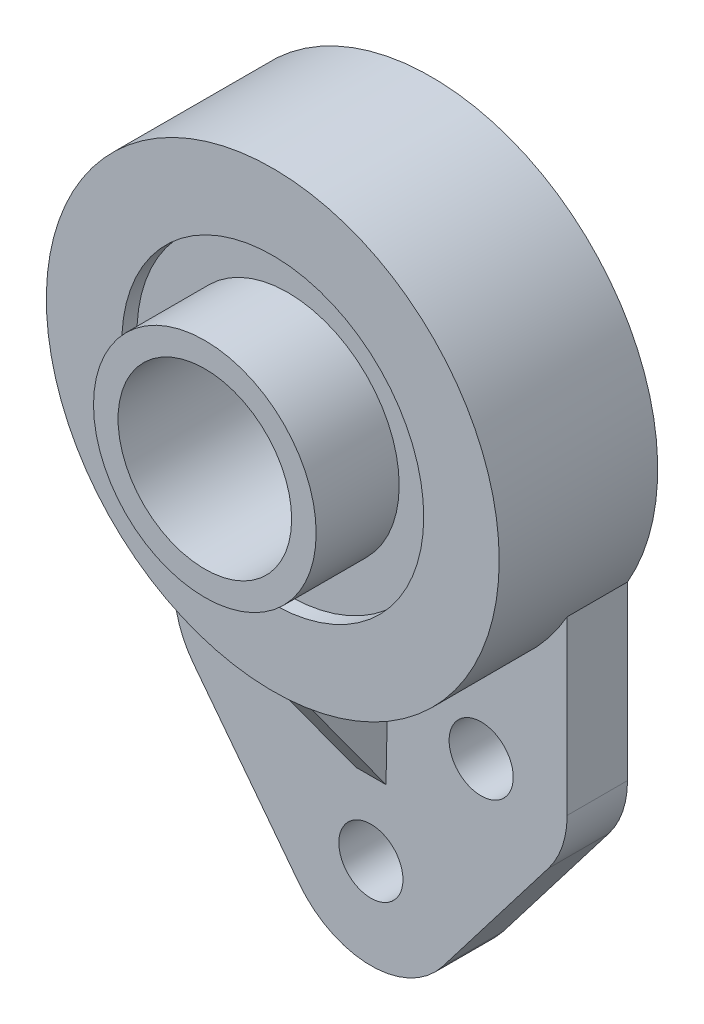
ISO-10303-21;
HEADER;
FILE_DESCRIPTION(('STEP AP214'),'2;1');
FILE_NAME('part.step','',(''),(''),'','','');
FILE_SCHEMA(('AUTOMOTIVE_DESIGN { 1 0 10303 214 1 1 1 1 }'));
ENDSEC;
DATA;
#1=APPLICATION_CONTEXT('core data for automotive mechanical design processes');
#2=APPLICATION_PROTOCOL_DEFINITION('international standard','automotive_design',2000,#1);
#3=PRODUCT_CONTEXT('',#1,'mechanical');
#4=PRODUCT('Part','Part','',(#3));
#5=PRODUCT_RELATED_PRODUCT_CATEGORY('part','',(#4));
#6=PRODUCT_DEFINITION_FORMATION('','',#4);
#7=PRODUCT_DEFINITION_CONTEXT('part definition',#1,'design');
#8=PRODUCT_DEFINITION('design','',#6,#7);
#9=PRODUCT_DEFINITION_SHAPE('','',#8);
#10=(LENGTH_UNIT() NAMED_UNIT(*) SI_UNIT(.MILLI.,.METRE.));
#11=(NAMED_UNIT(*) PLANE_ANGLE_UNIT() SI_UNIT($,.RADIAN.));
#12=(NAMED_UNIT(*) SI_UNIT($,.STERADIAN.) SOLID_ANGLE_UNIT());
#13=UNCERTAINTY_MEASURE_WITH_UNIT(LENGTH_MEASURE(1.E-05),#10,'distance_accuracy_value','');
#14=(GEOMETRIC_REPRESENTATION_CONTEXT(3) GLOBAL_UNCERTAINTY_ASSIGNED_CONTEXT((#13)) GLOBAL_UNIT_ASSIGNED_CONTEXT((#10,
#11,#12)) REPRESENTATION_CONTEXT('',''));
#15=CARTESIAN_POINT('',(0.,0.,0.));
#16=DIRECTION('',(0.,0.,1.));
#17=DIRECTION('',(1.,0.,0.));
#18=AXIS2_PLACEMENT_3D('',#15,#16,#17);
#19=CARTESIAN_POINT('',(0.,0.,30.1625));
#20=DIRECTION('',(0.,0.,1.));
#21=DIRECTION('',(1.,0.,0.));
#22=AXIS2_PLACEMENT_3D('',#19,#20,#21);
#23=PLANE('',#22);
#24=CARTESIAN_POINT('',(0.,0.,30.1625));
#25=DIRECTION('',(0.,0.,1.));
#26=DIRECTION('',(1.,0.,0.));
#27=AXIS2_PLACEMENT_3D('',#24,#25,#26);
#28=CIRCLE('',#27,31.75);
#29=CARTESIAN_POINT('',(31.75,0.,30.1625));
#30=VERTEX_POINT('',#29);
#31=EDGE_CURVE('E219',#30,#30,#28,.T.);
#32=ORIENTED_EDGE('',*,*,#31,.T.);
#33=EDGE_LOOP('',(#32));
#34=FACE_BOUND('',#33,.T.);
#35=CARTESIAN_POINT('',(0.,0.,30.1625));
#36=DIRECTION('',(0.,0.,1.));
#37=DIRECTION('',(1.,0.,0.));
#38=AXIS2_PLACEMENT_3D('',#35,#36,#37);
#39=CIRCLE('',#38,23.415625);
#40=CARTESIAN_POINT('',(23.415625,0.,30.1625));
#41=VERTEX_POINT('',#40);
#42=EDGE_CURVE('E32',#41,#41,#39,.F.);
#43=ORIENTED_EDGE('',*,*,#42,.T.);
#44=EDGE_LOOP('',(#43));
#45=FACE_BOUND('',#44,.T.);
#46=ADVANCED_FACE('F28',(#34,#45),#23,.T.);
#47=CARTESIAN_POINT('',(0.,-88.9,12.7));
#48=DIRECTION('',(0.,0.,1.));
#49=DIRECTION('',(1.,0.,0.));
#50=AXIS2_PLACEMENT_3D('',#47,#48,#49);
#51=PLANE('',#50);
#52=CARTESIAN_POINT('',(-23.1938104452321,-58.6732377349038,12.7));
#53=DIRECTION('',(0.,0.,1.));
#54=DIRECTION('',(1.,0.,0.));
#55=AXIS2_PLACEMENT_3D('',#52,#53,#54);
#56=CIRCLE('',#55,6.7437);
#57=CARTESIAN_POINT('',(-16.4501104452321,-58.6732377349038,12.7));
#58=VERTEX_POINT('',#57);
#59=EDGE_CURVE('E252',#58,#58,#56,.T.);
#60=ORIENTED_EDGE('',*,*,#59,.F.);
#61=EDGE_LOOP('',(#60));
#62=FACE_BOUND('',#61,.T.);
#63=CARTESIAN_POINT('',(23.1938104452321,-58.6732377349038,12.7));
#64=DIRECTION('',(0.,0.,1.));
#65=DIRECTION('',(1.,0.,0.));
#66=AXIS2_PLACEMENT_3D('',#63,#64,#65);
#67=CIRCLE('',#66,6.7437);
#68=CARTESIAN_POINT('',(29.9375104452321,-58.6732377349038,12.7));
#69=VERTEX_POINT('',#68);
#70=EDGE_CURVE('E246',#69,#69,#67,.T.);
#71=ORIENTED_EDGE('',*,*,#70,.F.);
#72=EDGE_LOOP('',(#71));
#73=FACE_BOUND('',#72,.T.);
#74=CARTESIAN_POINT('',(0.,-88.9,12.7));
#75=DIRECTION('',(0.,0.,1.));
#76=DIRECTION('',(1.,0.,0.));
#77=AXIS2_PLACEMENT_3D('',#74,#75,#76);
#78=CIRCLE('',#77,6.7437);
#79=CARTESIAN_POINT('',(6.74369999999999,-88.9,12.7));
#80=VERTEX_POINT('',#79);
#81=EDGE_CURVE('E240',#80,#80,#78,.T.);
#82=ORIENTED_EDGE('',*,*,#81,.F.);
#83=EDGE_LOOP('',(#82));
#84=FACE_BOUND('',#83,.T.);
#85=DIRECTION('',(0.0205273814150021,0.999789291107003,0.));
#86=VECTOR('',#85,1.);
#87=CARTESIAN_POINT('',(2.85509870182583,-88.9586200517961,12.7));
#88=LINE('',#87,#86);
#89=CARTESIAN_POINT('',(3.175,-73.3777777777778,12.7));
#90=VERTEX_POINT('',#89);
#91=CARTESIAN_POINT('',(3.70671468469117,-47.4805317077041,12.7));
#92=VERTEX_POINT('',#91);
#93=EDGE_CURVE('E44',#90,#92,#88,.T.);
#94=ORIENTED_EDGE('',*,*,#93,.F.);
#95=DIRECTION('',(1.,0.,0.));
#96=VECTOR('',#95,1.);
#97=CARTESIAN_POINT('',(0.,-73.3777777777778,12.7));
#98=LINE('',#97,#96);
#99=CARTESIAN_POINT('',(-3.175,-73.3777777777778,12.7));
#100=VERTEX_POINT('',#99);
#101=EDGE_CURVE('E48',#100,#90,#98,.T.);
#102=ORIENTED_EDGE('',*,*,#101,.F.);
#103=DIRECTION('',(-0.0205273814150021,0.999789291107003,0.));
#104=VECTOR('',#103,1.);
#105=CARTESIAN_POINT('',(-2.85509870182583,-88.9586200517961,12.7));
#106=LINE('',#105,#104);
#107=CARTESIAN_POINT('',(-3.70671468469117,-47.4805317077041,12.7));
#108=VERTEX_POINT('',#107);
#109=EDGE_CURVE('E123',#100,#108,#106,.T.);
#110=ORIENTED_EDGE('',*,*,#109,.T.);
#111=CARTESIAN_POINT('',(0.,0.,12.7));
#112=DIRECTION('',(0.,0.,1.));
#113=DIRECTION('',(1.,0.,0.));
#114=AXIS2_PLACEMENT_3D('',#111,#112,#113);
#115=CIRCLE('',#114,47.625);
#116=CARTESIAN_POINT('',(-41.275,-23.7595244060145,12.7));
#117=VERTEX_POINT('',#116);
#118=EDGE_CURVE('E111',#108,#117,#115,.F.);
#119=ORIENTED_EDGE('',*,*,#118,.T.);
#120=DIRECTION('',(0.,1.,0.));
#121=VECTOR('',#120,1.);
#122=CARTESIAN_POINT('',(-41.275,-59.9358160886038,12.7));
#123=LINE('',#122,#121);
#124=CARTESIAN_POINT('',(-41.275,-59.9358160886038,12.7));
#125=VERTEX_POINT('',#124);
#126=EDGE_CURVE('E174',#125,#117,#123,.T.);
#127=ORIENTED_EDGE('',*,*,#126,.F.);
#128=CARTESIAN_POINT('',(-22.225,-59.9358160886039,12.7));
#129=DIRECTION('',(0.,0.,-1.));
#130=DIRECTION('',(-1.,0.,0.));
#131=AXIS2_PLACEMENT_3D('',#128,#129,#130);
#132=CIRCLE('',#131,19.05);
#133=CARTESIAN_POINT('',(-37.3383811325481,-71.5327213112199,12.7));
#134=VERTEX_POINT('',#133);
#135=EDGE_CURVE('E176',#134,#125,#132,.T.);
#136=ORIENTED_EDGE('',*,*,#135,.F.);
#137=DIRECTION('',(-0.608761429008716,0.793353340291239,0.));
#138=VECTOR('',#137,1.);
#139=CARTESIAN_POINT('',(-15.1133811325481,-100.496905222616,12.7));
#140=LINE('',#139,#138);
#141=CARTESIAN_POINT('',(-15.1133811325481,-100.496905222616,12.7));
#142=VERTEX_POINT('',#141);
#143=EDGE_CURVE('E179',#142,#134,#140,.T.);
#144=ORIENTED_EDGE('',*,*,#143,.F.);
#145=CARTESIAN_POINT('',(0.,-88.9,12.7));
#146=DIRECTION('',(0.,0.,1.));
#147=DIRECTION('',(1.,0.,0.));
#148=AXIS2_PLACEMENT_3D('',#145,#146,#147);
#149=CIRCLE('',#148,19.05);
#150=CARTESIAN_POINT('',(15.1133811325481,-100.496905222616,12.7));
#151=VERTEX_POINT('',#150);
#152=EDGE_CURVE('E165',#142,#151,#149,.T.);
#153=ORIENTED_EDGE('',*,*,#152,.T.);
#154=DIRECTION('',(0.608761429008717,0.793353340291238,0.));
#155=VECTOR('',#154,1.);
#156=CARTESIAN_POINT('',(15.1133811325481,-100.496905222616,12.7));
#157=LINE('',#156,#155);
#158=CARTESIAN_POINT('',(37.3383811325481,-71.5327213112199,12.7));
#159=VERTEX_POINT('',#158);
#160=EDGE_CURVE('E168',#151,#159,#157,.T.);
#161=ORIENTED_EDGE('',*,*,#160,.T.);
#162=CARTESIAN_POINT('',(22.225,-59.9358160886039,12.7));
#163=DIRECTION('',(0.,0.,1.));
#164=DIRECTION('',(1.,0.,0.));
#165=AXIS2_PLACEMENT_3D('',#162,#163,#164);
#166=CIRCLE('',#165,19.05);
#167=CARTESIAN_POINT('',(41.275,-59.9358160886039,12.7));
#168=VERTEX_POINT('',#167);
#169=EDGE_CURVE('E170',#159,#168,#166,.T.);
#170=ORIENTED_EDGE('',*,*,#169,.T.);
#171=DIRECTION('',(0.,1.,0.));
#172=VECTOR('',#171,1.);
#173=CARTESIAN_POINT('',(41.275,-59.9358160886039,12.7));
#174=LINE('',#173,#172);
#175=CARTESIAN_POINT('',(41.275,-23.7595244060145,12.7));
#176=VERTEX_POINT('',#175);
#177=EDGE_CURVE('E172',#168,#176,#174,.T.);
#178=ORIENTED_EDGE('',*,*,#177,.T.);
#179=EDGE_CURVE('E120',#176,#92,#115,.F.);
#180=ORIENTED_EDGE('',*,*,#179,.T.);
#181=EDGE_LOOP('',(#94,#102,#110,#119,#127,#136,#144,#153,#161,#170,#178,#180));
#182=FACE_BOUND('',#181,.T.);
#183=ADVANCED_FACE('F124',(#62,#73,#84,#182),#51,.T.);
#184=CARTESIAN_POINT('',(0.,-88.9,12.7));
#185=DIRECTION('',(0.,0.,-1.));
#186=DIRECTION('',(-1.,0.,0.));
#187=AXIS2_PLACEMENT_3D('',#184,#185,#186);
#188=CYLINDRICAL_SURFACE('',#187,19.05);
#189=CARTESIAN_POINT('',(0.,-88.9,0.));
#190=DIRECTION('',(0.,0.,1.));
#191=DIRECTION('',(1.,0.,0.));
#192=AXIS2_PLACEMENT_3D('',#189,#190,#191);
#193=CIRCLE('',#192,19.05);
#194=CARTESIAN_POINT('',(-15.1133811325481,-100.496905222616,0.));
#195=VERTEX_POINT('',#194);
#196=CARTESIAN_POINT('',(15.1133811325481,-100.496905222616,0.));
#197=VERTEX_POINT('',#196);
#198=EDGE_CURVE('E145',#195,#197,#193,.T.);
#199=ORIENTED_EDGE('',*,*,#198,.T.);
#200=DIRECTION('',(0.,0.,-1.));
#201=VECTOR('',#200,1.);
#202=CARTESIAN_POINT('',(15.1133811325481,-100.496905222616,12.7));
#203=LINE('',#202,#201);
#204=EDGE_CURVE('E11',#151,#197,#203,.T.);
#205=ORIENTED_EDGE('',*,*,#204,.F.);
#206=ORIENTED_EDGE('',*,*,#152,.F.);
#207=DIRECTION('',(0.,0.,-1.));
#208=VECTOR('',#207,1.);
#209=CARTESIAN_POINT('',(-15.1133811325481,-100.496905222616,12.7));
#210=LINE('',#209,#208);
#211=EDGE_CURVE('E182',#142,#195,#210,.T.);
#212=ORIENTED_EDGE('',*,*,#211,.T.);
#213=EDGE_LOOP('',(#199,#205,#206,#212));
#214=FACE_BOUND('',#213,.T.);
#215=ADVANCED_FACE('F30',(#214),#188,.T.);
#216=CARTESIAN_POINT('',(15.1133811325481,-100.496905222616,12.7));
#217=DIRECTION('',(-0.793353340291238,0.608761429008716,0.));
#218=DIRECTION('',(-0.608761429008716,-0.793353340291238,0.));
#219=AXIS2_PLACEMENT_3D('',#216,#217,#218);
#220=PLANE('',#219);
#221=DIRECTION('',(0.608761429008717,0.793353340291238,0.));
#222=VECTOR('',#221,1.);
#223=CARTESIAN_POINT('',(15.1133811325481,-100.496905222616,0.));
#224=LINE('',#223,#222);
#225=CARTESIAN_POINT('',(37.3383811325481,-71.5327213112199,0.));
#226=VERTEX_POINT('',#225);
#227=EDGE_CURVE('E148',#197,#226,#224,.T.);
#228=ORIENTED_EDGE('',*,*,#227,.T.);
#229=DIRECTION('',(0.,0.,-1.));
#230=VECTOR('',#229,1.);
#231=CARTESIAN_POINT('',(37.3383811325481,-71.5327213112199,12.7));
#232=LINE('',#231,#230);
#233=EDGE_CURVE('E37',#159,#226,#232,.T.);
#234=ORIENTED_EDGE('',*,*,#233,.F.);
#235=ORIENTED_EDGE('',*,*,#160,.F.);
#236=ORIENTED_EDGE('',*,*,#204,.T.);
#237=EDGE_LOOP('',(#228,#234,#235,#236));
#238=FACE_BOUND('',#237,.T.);
#239=ADVANCED_FACE('F326',(#238),#220,.F.);
#240=CARTESIAN_POINT('',(22.225,-59.9358160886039,12.7));
#241=DIRECTION('',(0.,0.,-1.));
#242=DIRECTION('',(-1.,0.,0.));
#243=AXIS2_PLACEMENT_3D('',#240,#241,#242);
#244=CYLINDRICAL_SURFACE('',#243,19.05);
#245=CARTESIAN_POINT('',(22.225,-59.9358160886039,0.));
#246=DIRECTION('',(0.,0.,1.));
#247=DIRECTION('',(1.,0.,0.));
#248=AXIS2_PLACEMENT_3D('',#245,#246,#247);
#249=CIRCLE('',#248,19.05);
#250=CARTESIAN_POINT('',(41.275,-59.9358160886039,0.));
#251=VERTEX_POINT('',#250);
#252=EDGE_CURVE('E150',#226,#251,#249,.T.);
#253=ORIENTED_EDGE('',*,*,#252,.T.);
#254=DIRECTION('',(0.,0.,-1.));
#255=VECTOR('',#254,1.);
#256=CARTESIAN_POINT('',(41.275,-59.9358160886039,12.7));
#257=LINE('',#256,#255);
#258=EDGE_CURVE('E192',#168,#251,#257,.T.);
#259=ORIENTED_EDGE('',*,*,#258,.F.);
#260=ORIENTED_EDGE('',*,*,#169,.F.);
#261=ORIENTED_EDGE('',*,*,#233,.T.);
#262=EDGE_LOOP('',(#253,#259,#260,#261));
#263=FACE_BOUND('',#262,.T.);
#264=ADVANCED_FACE('F200',(#263),#244,.T.);
#265=CARTESIAN_POINT('',(41.275,-59.9358160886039,12.7));
#266=DIRECTION('',(-1.,0.,0.));
#267=DIRECTION('',(0.,-1.,0.));
#268=AXIS2_PLACEMENT_3D('',#265,#266,#267);
#269=PLANE('',#268);
#270=DIRECTION('',(0.,1.,0.));
#271=VECTOR('',#270,1.);
#272=CARTESIAN_POINT('',(41.275,-59.9358160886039,0.));
#273=LINE('',#272,#271);
#274=CARTESIAN_POINT('',(41.275,-23.7595244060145,0.));
#275=VERTEX_POINT('',#274);
#276=EDGE_CURVE('E152',#251,#275,#273,.T.);
#277=ORIENTED_EDGE('',*,*,#276,.T.);
#278=DIRECTION('',(0.,0.,-1.));
#279=VECTOR('',#278,1.);
#280=CARTESIAN_POINT('',(41.275,-23.7595244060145,12.7));
#281=LINE('',#280,#279);
#282=EDGE_CURVE('E189',#176,#275,#281,.T.);
#283=ORIENTED_EDGE('',*,*,#282,.F.);
#284=ORIENTED_EDGE('',*,*,#177,.F.);
#285=ORIENTED_EDGE('',*,*,#258,.T.);
#286=EDGE_LOOP('',(#277,#283,#284,#285));
#287=FACE_BOUND('',#286,.T.);
#288=ADVANCED_FACE('F210',(#287),#269,.F.);
#289=CARTESIAN_POINT('',(0.,0.,12.7));
#290=DIRECTION('',(0.,0.,-1.));
#291=DIRECTION('',(-1.,0.,0.));
#292=AXIS2_PLACEMENT_3D('',#289,#290,#291);
#293=CYLINDRICAL_SURFACE('',#292,47.625);
#294=CARTESIAN_POINT('',(0.,0.,33.3375));
#295=DIRECTION('',(0.,0.,1.));
#296=DIRECTION('',(1.,0.,0.));
#297=AXIS2_PLACEMENT_3D('',#294,#295,#296);
#298=CIRCLE('',#297,47.625);
#299=CARTESIAN_POINT('',(47.625,0.,33.3375));
#300=VERTEX_POINT('',#299);
#301=EDGE_CURVE('E121',#300,#300,#298,.T.);
#302=ORIENTED_EDGE('',*,*,#301,.F.);
#303=EDGE_LOOP('',(#302));
#304=FACE_BOUND('',#303,.T.);
#305=CARTESIAN_POINT('',(0.,0.,0.));
#306=DIRECTION('',(0.,0.,1.));
#307=DIRECTION('',(1.,0.,0.));
#308=AXIS2_PLACEMENT_3D('',#305,#306,#307);
#309=CIRCLE('',#308,47.625);
#310=CARTESIAN_POINT('',(-41.275,-23.7595244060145,0.));
#311=VERTEX_POINT('',#310);
#312=EDGE_CURVE('E154',#275,#311,#309,.T.);
#313=ORIENTED_EDGE('',*,*,#312,.T.);
#314=DIRECTION('',(0.,0.,-1.));
#315=VECTOR('',#314,1.);
#316=CARTESIAN_POINT('',(-41.275,-23.7595244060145,12.7));
#317=LINE('',#316,#315);
#318=EDGE_CURVE('E117',#117,#311,#317,.T.);
#319=ORIENTED_EDGE('',*,*,#318,.F.);
#320=ORIENTED_EDGE('',*,*,#118,.F.);
#321=CARTESIAN_POINT('',(0.,0.,178.435256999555));
#322=DIRECTION('',(0.999390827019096,0.0205192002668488,-0.0282300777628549));
#323=DIRECTION('',(-0.0282241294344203,-0.000579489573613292,-0.999601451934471));
#324=AXIS2_PLACEMENT_3D('',#321,#322,#323);
#325=ELLIPSE('',#324,1687.03042195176,47.625);
#326=CARTESIAN_POINT('',(-3.175,-47.5190488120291,31.4955712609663));
#327=VERTEX_POINT('',#326);
#328=EDGE_CURVE('E114',#327,#108,#325,.T.);
#329=ORIENTED_EDGE('',*,*,#328,.F.);
#330=CARTESIAN_POINT('',(0.,0.,66.035075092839));
#331=DIRECTION('',(0.,-0.587951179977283,0.808896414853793));
#332=DIRECTION('',(0.,-0.808896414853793,-0.587951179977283));
#333=AXIS2_PLACEMENT_3D('',#330,#331,#332);
#334=ELLIPSE('',#333,58.8765126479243,47.625);
#335=CARTESIAN_POINT('',(3.175,-47.5190488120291,31.4955712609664));
#336=VERTEX_POINT('',#335);
#337=EDGE_CURVE('E140',#327,#336,#334,.T.);
#338=ORIENTED_EDGE('',*,*,#337,.T.);
#339=CARTESIAN_POINT('',(0.,0.,178.435256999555));
#340=DIRECTION('',(0.999390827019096,-0.0205192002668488,0.0282300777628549));
#341=DIRECTION('',(0.0282241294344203,-0.000579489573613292,-0.999601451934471));
#342=AXIS2_PLACEMENT_3D('',#339,#340,#341);
#343=ELLIPSE('',#342,1687.03042195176,47.625);
#344=EDGE_CURVE('E128',#336,#92,#343,.T.);
#345=ORIENTED_EDGE('',*,*,#344,.T.);
#346=ORIENTED_EDGE('',*,*,#179,.F.);
#347=ORIENTED_EDGE('',*,*,#282,.T.);
#348=EDGE_LOOP('',(#313,#319,#320,#329,#338,#345,#346,#347));
#349=FACE_BOUND('',#348,.T.);
#350=ADVANCED_FACE('F112',(#304,#349),#293,.T.);
#351=CARTESIAN_POINT('',(-41.275,-59.9358160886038,12.7));
#352=DIRECTION('',(-1.,0.,0.));
#353=DIRECTION('',(0.,-1.,0.));
#354=AXIS2_PLACEMENT_3D('',#351,#352,#353);
#355=PLANE('',#354);
#356=DIRECTION('',(0.,1.,0.));
#357=VECTOR('',#356,1.);
#358=CARTESIAN_POINT('',(-41.275,-59.9358160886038,0.));
#359=LINE('',#358,#357);
#360=CARTESIAN_POINT('',(-41.275,-59.9358160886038,0.));
#361=VERTEX_POINT('',#360);
#362=EDGE_CURVE('E156',#361,#311,#359,.T.);
#363=ORIENTED_EDGE('',*,*,#362,.F.);
#364=DIRECTION('',(0.,0.,-1.));
#365=VECTOR('',#364,1.);
#366=CARTESIAN_POINT('',(-41.275,-59.9358160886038,12.7));
#367=LINE('',#366,#365);
#368=EDGE_CURVE('E186',#125,#361,#367,.T.);
#369=ORIENTED_EDGE('',*,*,#368,.F.);
#370=ORIENTED_EDGE('',*,*,#126,.T.);
#371=ORIENTED_EDGE('',*,*,#318,.T.);
#372=EDGE_LOOP('',(#363,#369,#370,#371));
#373=FACE_BOUND('',#372,.T.);
#374=ADVANCED_FACE('F315',(#373),#355,.T.);
#375=CARTESIAN_POINT('',(-22.225,-59.9358160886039,12.7));
#376=DIRECTION('',(0.,0.,-1.));
#377=DIRECTION('',(-1.,0.,0.));
#378=AXIS2_PLACEMENT_3D('',#375,#376,#377);
#379=CYLINDRICAL_SURFACE('',#378,19.05);
#380=CARTESIAN_POINT('',(-22.225,-59.9358160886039,0.));
#381=DIRECTION('',(0.,0.,-1.));
#382=DIRECTION('',(-1.,0.,0.));
#383=AXIS2_PLACEMENT_3D('',#380,#381,#382);
#384=CIRCLE('',#383,19.05);
#385=CARTESIAN_POINT('',(-37.3383811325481,-71.5327213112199,0.));
#386=VERTEX_POINT('',#385);
#387=EDGE_CURVE('E159',#386,#361,#384,.T.);
#388=ORIENTED_EDGE('',*,*,#387,.F.);
#389=DIRECTION('',(0.,0.,-1.));
#390=VECTOR('',#389,1.);
#391=CARTESIAN_POINT('',(-37.3383811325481,-71.5327213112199,12.7));
#392=LINE('',#391,#390);
#393=EDGE_CURVE('E184',#134,#386,#392,.T.);
#394=ORIENTED_EDGE('',*,*,#393,.F.);
#395=ORIENTED_EDGE('',*,*,#135,.T.);
#396=ORIENTED_EDGE('',*,*,#368,.T.);
#397=EDGE_LOOP('',(#388,#394,#395,#396));
#398=FACE_BOUND('',#397,.T.);
#399=ADVANCED_FACE('F311',(#398),#379,.T.);
#400=CARTESIAN_POINT('',(-15.1133811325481,-100.496905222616,12.7));
#401=DIRECTION('',(-0.793353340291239,-0.608761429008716,0.));
#402=DIRECTION('',(0.608761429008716,-0.793353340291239,0.));
#403=AXIS2_PLACEMENT_3D('',#400,#401,#402);
#404=PLANE('',#403);
#405=DIRECTION('',(-0.608761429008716,0.793353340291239,0.));
#406=VECTOR('',#405,1.);
#407=CARTESIAN_POINT('',(-15.1133811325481,-100.496905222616,0.));
#408=LINE('',#407,#406);
#409=EDGE_CURVE('E162',#195,#386,#408,.T.);
#410=ORIENTED_EDGE('',*,*,#409,.F.);
#411=ORIENTED_EDGE('',*,*,#211,.F.);
#412=ORIENTED_EDGE('',*,*,#143,.T.);
#413=ORIENTED_EDGE('',*,*,#393,.T.);
#414=EDGE_LOOP('',(#410,#411,#412,#413));
#415=FACE_BOUND('',#414,.T.);
#416=ADVANCED_FACE('F306',(#415),#404,.T.);
#417=CARTESIAN_POINT('',(0.,-88.9,0.));
#418=DIRECTION('',(0.,0.,1.));
#419=DIRECTION('',(1.,0.,0.));
#420=AXIS2_PLACEMENT_3D('',#417,#418,#419);
#421=PLANE('',#420);
#422=CARTESIAN_POINT('',(-23.1938104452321,-58.6732377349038,0.));
#423=DIRECTION('',(0.,0.,1.));
#424=DIRECTION('',(1.,0.,0.));
#425=AXIS2_PLACEMENT_3D('',#422,#423,#424);
#426=CIRCLE('',#425,6.7437);
#427=CARTESIAN_POINT('',(-16.4501104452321,-58.6732377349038,0.));
#428=VERTEX_POINT('',#427);
#429=EDGE_CURVE('E249',#428,#428,#426,.T.);
#430=ORIENTED_EDGE('',*,*,#429,.T.);
#431=EDGE_LOOP('',(#430));
#432=FACE_BOUND('',#431,.T.);
#433=CARTESIAN_POINT('',(23.1938104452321,-58.6732377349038,0.));
#434=DIRECTION('',(0.,0.,1.));
#435=DIRECTION('',(1.,0.,0.));
#436=AXIS2_PLACEMENT_3D('',#433,#434,#435);
#437=CIRCLE('',#436,6.7437);
#438=CARTESIAN_POINT('',(29.9375104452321,-58.6732377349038,0.));
#439=VERTEX_POINT('',#438);
#440=EDGE_CURVE('E243',#439,#439,#437,.T.);
#441=ORIENTED_EDGE('',*,*,#440,.T.);
#442=EDGE_LOOP('',(#441));
#443=FACE_BOUND('',#442,.T.);
#444=CARTESIAN_POINT('',(0.,-88.9,0.));
#445=DIRECTION('',(0.,0.,1.));
#446=DIRECTION('',(1.,0.,0.));
#447=AXIS2_PLACEMENT_3D('',#444,#445,#446);
#448=CIRCLE('',#447,6.7437);
#449=CARTESIAN_POINT('',(6.74369999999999,-88.9,0.));
#450=VERTEX_POINT('',#449);
#451=EDGE_CURVE('E237',#450,#450,#448,.T.);
#452=ORIENTED_EDGE('',*,*,#451,.T.);
#453=EDGE_LOOP('',(#452));
#454=FACE_BOUND('',#453,.T.);
#455=CARTESIAN_POINT('',(0.,0.,0.));
#456=DIRECTION('',(0.,0.,1.));
#457=DIRECTION('',(1.,0.,0.));
#458=AXIS2_PLACEMENT_3D('',#455,#456,#457);
#459=CIRCLE('',#458,18.25625);
#460=CARTESIAN_POINT('',(18.25625,0.,0.));
#461=VERTEX_POINT('',#460);
#462=EDGE_CURVE('E231',#461,#461,#459,.T.);
#463=ORIENTED_EDGE('',*,*,#462,.T.);
#464=EDGE_LOOP('',(#463));
#465=FACE_BOUND('',#464,.T.);
#466=ORIENTED_EDGE('',*,*,#362,.T.);
#467=ORIENTED_EDGE('',*,*,#312,.F.);
#468=ORIENTED_EDGE('',*,*,#276,.F.);
#469=ORIENTED_EDGE('',*,*,#252,.F.);
#470=ORIENTED_EDGE('',*,*,#227,.F.);
#471=ORIENTED_EDGE('',*,*,#198,.F.);
#472=ORIENTED_EDGE('',*,*,#409,.T.);
#473=ORIENTED_EDGE('',*,*,#387,.T.);
#474=EDGE_LOOP('',(#466,#467,#468,#469,#470,#471,#472,#473));
#475=FACE_BOUND('',#474,.T.);
#476=ADVANCED_FACE('F205',(#432,#443,#454,#465,#475),#421,.F.);
#477=CARTESIAN_POINT('',(0.,0.,33.3375));
#478=DIRECTION('',(0.,0.,1.));
#479=DIRECTION('',(1.,0.,0.));
#480=AXIS2_PLACEMENT_3D('',#477,#478,#479);
#481=PLANE('',#480);
#482=CARTESIAN_POINT('',(0.,0.,33.3375));
#483=DIRECTION('',(0.,0.,1.));
#484=DIRECTION('',(1.,0.,0.));
#485=AXIS2_PLACEMENT_3D('',#482,#483,#484);
#486=CIRCLE('',#485,31.75);
#487=CARTESIAN_POINT('',(31.75,0.,33.3375));
#488=VERTEX_POINT('',#487);
#489=EDGE_CURVE('E221',#488,#488,#486,.T.);
#490=ORIENTED_EDGE('',*,*,#489,.F.);
#491=EDGE_LOOP('',(#490));
#492=FACE_BOUND('',#491,.T.);
#493=ORIENTED_EDGE('',*,*,#301,.T.);
#494=EDGE_LOOP('',(#493));
#495=FACE_BOUND('',#494,.T.);
#496=ADVANCED_FACE('F297',(#492,#495),#481,.T.);
#497=CARTESIAN_POINT('',(0.,-47.6721384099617,31.3842971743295));
#498=DIRECTION('',(0.,-0.587951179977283,0.808896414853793));
#499=DIRECTION('',(0.,-0.808896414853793,-0.587951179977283));
#500=AXIS2_PLACEMENT_3D('',#497,#498,#499);
#501=PLANE('',#500);
#502=DIRECTION('',(0.,0.808896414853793,0.587951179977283));
#503=VECTOR('',#502,1.);
#504=CARTESIAN_POINT('',(-3.175,-47.6721384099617,31.3842971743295));
#505=LINE('',#504,#503);
#506=EDGE_CURVE('E131',#327,#100,#505,.F.);
#507=ORIENTED_EDGE('',*,*,#506,.T.);
#508=ORIENTED_EDGE('',*,*,#101,.T.);
#509=DIRECTION('',(0.,-0.808896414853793,-0.587951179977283));
#510=VECTOR('',#509,1.);
#511=CARTESIAN_POINT('',(3.175,-43.2139378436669,34.624766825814));
#512=LINE('',#511,#510);
#513=EDGE_CURVE('E132',#336,#90,#512,.T.);
#514=ORIENTED_EDGE('',*,*,#513,.F.);
#515=ORIENTED_EDGE('',*,*,#337,.F.);
#516=EDGE_LOOP('',(#507,#508,#514,#515));
#517=FACE_BOUND('',#516,.T.);
#518=ADVANCED_FACE('F218',(#517),#501,.T.);
#519=CARTESIAN_POINT('',(3.175,-43.2139378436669,34.624766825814));
#520=DIRECTION('',(0.999390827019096,-0.0205192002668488,0.0282300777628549));
#521=DIRECTION('',(0.0282360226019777,0.,-0.999601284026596));
#522=AXIS2_PLACEMENT_3D('',#519,#520,#521);
#523=PLANE('',#522);
#524=ORIENTED_EDGE('',*,*,#513,.T.);
#525=ORIENTED_EDGE('',*,*,#93,.T.);
#526=ORIENTED_EDGE('',*,*,#344,.F.);
#527=EDGE_LOOP('',(#524,#525,#526));
#528=FACE_BOUND('',#527,.T.);
#529=ADVANCED_FACE('F215',(#528),#523,.T.);
#530=CARTESIAN_POINT('',(-3.175,-43.2139378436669,34.624766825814));
#531=DIRECTION('',(0.999390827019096,0.0205192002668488,-0.0282300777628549));
#532=DIRECTION('',(-0.0282360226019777,0.,-0.999601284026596));
#533=AXIS2_PLACEMENT_3D('',#530,#531,#532);
#534=PLANE('',#533);
#535=ORIENTED_EDGE('',*,*,#109,.F.);
#536=ORIENTED_EDGE('',*,*,#506,.F.);
#537=ORIENTED_EDGE('',*,*,#328,.T.);
#538=EDGE_LOOP('',(#535,#536,#537));
#539=FACE_BOUND('',#538,.T.);
#540=ADVANCED_FACE('F130',(#539),#534,.F.);
#541=CARTESIAN_POINT('',(0.,0.,30.1625));
#542=DIRECTION('',(0.,0.,1.));
#543=DIRECTION('',(1.,0.,0.));
#544=AXIS2_PLACEMENT_3D('',#541,#542,#543);
#545=CYLINDRICAL_SURFACE('',#544,31.75);
#546=ORIENTED_EDGE('',*,*,#31,.F.);
#547=EDGE_LOOP('',(#546));
#548=FACE_BOUND('',#547,.T.);
#549=ORIENTED_EDGE('',*,*,#489,.T.);
#550=EDGE_LOOP('',(#549));
#551=FACE_BOUND('',#550,.T.);
#552=ADVANCED_FACE('F292',(#548,#551),#545,.F.);
#553=CARTESIAN_POINT('',(0.,0.,47.625));
#554=DIRECTION('',(0.,0.,-1.));
#555=DIRECTION('',(-1.,0.,0.));
#556=AXIS2_PLACEMENT_3D('',#553,#554,#555);
#557=CYLINDRICAL_SURFACE('',#556,23.415625);
#558=ORIENTED_EDGE('',*,*,#42,.F.);
#559=EDGE_LOOP('',(#558));
#560=FACE_BOUND('',#559,.T.);
#561=CARTESIAN_POINT('',(0.,0.,47.625));
#562=DIRECTION('',(0.,0.,1.));
#563=DIRECTION('',(1.,0.,0.));
#564=AXIS2_PLACEMENT_3D('',#561,#562,#563);
#565=CIRCLE('',#564,23.415625);
#566=CARTESIAN_POINT('',(23.415625,0.,47.625));
#567=VERTEX_POINT('',#566);
#568=EDGE_CURVE('E228',#567,#567,#565,.T.);
#569=ORIENTED_EDGE('',*,*,#568,.F.);
#570=EDGE_LOOP('',(#569));
#571=FACE_BOUND('',#570,.T.);
#572=ADVANCED_FACE('F290',(#560,#571),#557,.T.);
#573=CARTESIAN_POINT('',(0.,0.,47.625));
#574=DIRECTION('',(0.,0.,1.));
#575=DIRECTION('',(1.,0.,0.));
#576=AXIS2_PLACEMENT_3D('',#573,#574,#575);
#577=PLANE('',#576);
#578=CARTESIAN_POINT('',(0.,0.,47.625));
#579=DIRECTION('',(0.,0.,1.));
#580=DIRECTION('',(1.,0.,0.));
#581=AXIS2_PLACEMENT_3D('',#578,#579,#580);
#582=CIRCLE('',#581,18.25625);
#583=CARTESIAN_POINT('',(18.25625,0.,47.625));
#584=VERTEX_POINT('',#583);
#585=EDGE_CURVE('E234',#584,#584,#582,.T.);
#586=ORIENTED_EDGE('',*,*,#585,.F.);
#587=EDGE_LOOP('',(#586));
#588=FACE_BOUND('',#587,.T.);
#589=ORIENTED_EDGE('',*,*,#568,.T.);
#590=EDGE_LOOP('',(#589));
#591=FACE_BOUND('',#590,.T.);
#592=ADVANCED_FACE('F277',(#588,#591),#577,.T.);
#593=CARTESIAN_POINT('',(0.,0.,0.));
#594=DIRECTION('',(0.,0.,1.));
#595=DIRECTION('',(1.,0.,0.));
#596=AXIS2_PLACEMENT_3D('',#593,#594,#595);
#597=CYLINDRICAL_SURFACE('',#596,18.25625);
#598=ORIENTED_EDGE('',*,*,#462,.F.);
#599=EDGE_LOOP('',(#598));
#600=FACE_BOUND('',#599,.T.);
#601=ORIENTED_EDGE('',*,*,#585,.T.);
#602=EDGE_LOOP('',(#601));
#603=FACE_BOUND('',#602,.T.);
#604=ADVANCED_FACE('F268',(#600,#603),#597,.F.);
#605=CARTESIAN_POINT('',(0.,-88.9,0.));
#606=DIRECTION('',(0.,0.,1.));
#607=DIRECTION('',(1.,0.,0.));
#608=AXIS2_PLACEMENT_3D('',#605,#606,#607);
#609=CYLINDRICAL_SURFACE('',#608,6.7437);
#610=ORIENTED_EDGE('',*,*,#451,.F.);
#611=EDGE_LOOP('',(#610));
#612=FACE_BOUND('',#611,.T.);
#613=ORIENTED_EDGE('',*,*,#81,.T.);
#614=EDGE_LOOP('',(#613));
#615=FACE_BOUND('',#614,.T.);
#616=ADVANCED_FACE('F265',(#612,#615),#609,.F.);
#617=CARTESIAN_POINT('',(23.1938104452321,-58.6732377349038,0.));
#618=DIRECTION('',(0.,0.,1.));
#619=DIRECTION('',(1.,0.,0.));
#620=AXIS2_PLACEMENT_3D('',#617,#618,#619);
#621=CYLINDRICAL_SURFACE('',#620,6.7437);
#622=ORIENTED_EDGE('',*,*,#440,.F.);
#623=EDGE_LOOP('',(#622));
#624=FACE_BOUND('',#623,.T.);
#625=ORIENTED_EDGE('',*,*,#70,.T.);
#626=EDGE_LOOP('',(#625));
#627=FACE_BOUND('',#626,.T.);
#628=ADVANCED_FACE('F267',(#624,#627),#621,.F.);
#629=CARTESIAN_POINT('',(-23.1938104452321,-58.6732377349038,0.));
#630=DIRECTION('',(0.,0.,1.));
#631=DIRECTION('',(1.,0.,0.));
#632=AXIS2_PLACEMENT_3D('',#629,#630,#631);
#633=CYLINDRICAL_SURFACE('',#632,6.7437);
#634=ORIENTED_EDGE('',*,*,#429,.F.);
#635=EDGE_LOOP('',(#634));
#636=FACE_BOUND('',#635,.T.);
#637=ORIENTED_EDGE('',*,*,#59,.T.);
#638=EDGE_LOOP('',(#637));
#639=FACE_BOUND('',#638,.T.);
#640=ADVANCED_FACE('F256',(#636,#639),#633,.F.);
#641=CLOSED_SHELL('',(#46,#183,#215,#239,#264,#288,#350,#374,#399,#416,#476,#496,#518,#529,#540,
#552,#572,#592,#604,#616,#628,#640));
#642=MANIFOLD_SOLID_BREP('B2',#641);
#643=ADVANCED_BREP_SHAPE_REPRESENTATION('',(#18,#642),#14);
#644=SHAPE_DEFINITION_REPRESENTATION(#9,#643);
ENDSEC;
END-ISO-10303-21;
